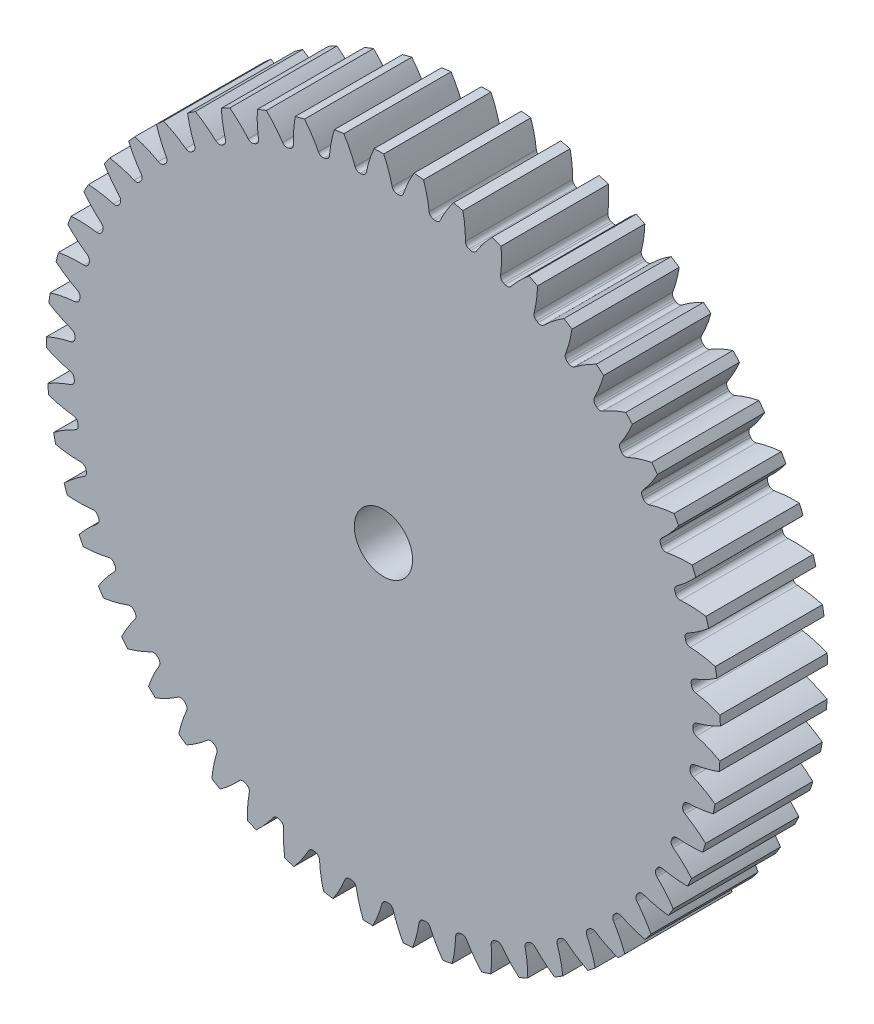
from build123d import *

# Parameters (mm, degrees)
SKETCH3_R         = 279.4
GEARBODY_DEPTH    = 88.9
TOOTHCUT_DEPTH    = 406.008555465
CIRPATTERN1_COUNT = 53
BOREDIA_R         = 24.13
BORE_DEPTH        = 12700


with BuildPart() as part:
    # Sketch3 → gearBody (new body)
    with BuildSketch(Plane.XY):
        Circle(SKETCH3_R)
    extrude(amount=GEARBODY_DEPTH)

    # Sketch2 → toothCut (cut, through all)
    with BuildSketch(Plane.XY):
        with BuildLine():
            ThreePointArc((256.494373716, -4.838166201), (256.506441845, -4.149324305), (256.516660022, -3.460452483))
            ThreePointArc((256.516660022, -3.460452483), (257.387582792, -0.977197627), (259.580329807, 0.477766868))
            ThreePointArc((259.580329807, 0.477766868), (269.694659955, 3.77756446), (279.4, 8.135856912))
            ThreePointArc((279.4, 8.135856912), (279.481865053, -4.520981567), (278.990668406, -17.16855003))
            ThreePointArc((278.990668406, -17.16855003), (269.431371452, -12.498627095), (259.429062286, -8.873416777))
            ThreePointArc((259.429062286, -8.873416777), (257.284522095, -7.348291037), (256.494373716, -4.838166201))
        make_face()
    toothcut = extrude(amount=TOOTHCUT_DEPTH, mode=Mode.SUBTRACT)

    # CirPattern1: toothCut ×53 about axis
    cirpattern1_axis = Axis((0, 0, 0), (0, 0, 1))
    for i in range(1, CIRPATTERN1_COUNT):
        add(toothcut.rotate(cirpattern1_axis, i * 360 / CIRPATTERN1_COUNT), mode=Mode.SUBTRACT)

    # boreDia → bore (cut, symmetric)
    with BuildSketch(Plane.XY):
        Circle(BOREDIA_R)
    extrude(amount=BORE_DEPTH, both=True, mode=Mode.SUBTRACT)


solid = part.part
